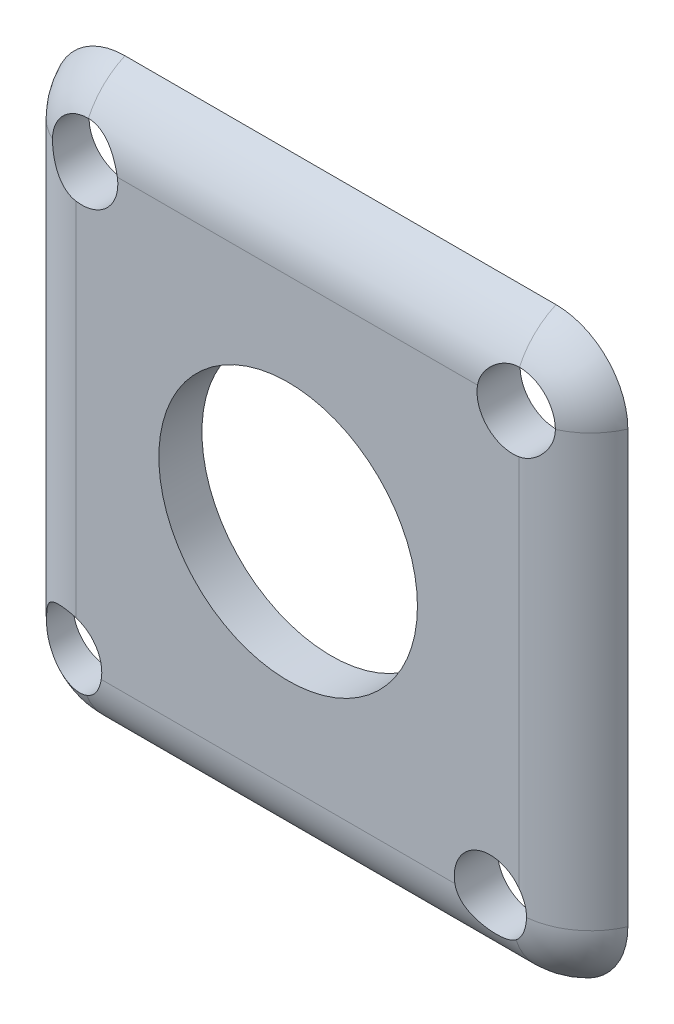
ISO-10303-21;
HEADER;
FILE_DESCRIPTION(('STEP AP214'),'2;1');
FILE_NAME('part.step','',(''),(''),'','','');
FILE_SCHEMA(('AUTOMOTIVE_DESIGN { 1 0 10303 214 1 1 1 1 }'));
ENDSEC;
DATA;
#1=APPLICATION_CONTEXT('core data for automotive mechanical design processes');
#2=APPLICATION_PROTOCOL_DEFINITION('international standard','automotive_design',2000,#1);
#3=PRODUCT_CONTEXT('',#1,'mechanical');
#4=PRODUCT('Part','Part','',(#3));
#5=PRODUCT_RELATED_PRODUCT_CATEGORY('part','',(#4));
#6=PRODUCT_DEFINITION_FORMATION('','',#4);
#7=PRODUCT_DEFINITION_CONTEXT('part definition',#1,'design');
#8=PRODUCT_DEFINITION('design','',#6,#7);
#9=PRODUCT_DEFINITION_SHAPE('','',#8);
#10=(LENGTH_UNIT() NAMED_UNIT(*) SI_UNIT(.MILLI.,.METRE.));
#11=(NAMED_UNIT(*) PLANE_ANGLE_UNIT() SI_UNIT($,.RADIAN.));
#12=(NAMED_UNIT(*) SI_UNIT($,.STERADIAN.) SOLID_ANGLE_UNIT());
#13=UNCERTAINTY_MEASURE_WITH_UNIT(LENGTH_MEASURE(1.E-05),#10,'distance_accuracy_value','');
#14=(GEOMETRIC_REPRESENTATION_CONTEXT(3) GLOBAL_UNCERTAINTY_ASSIGNED_CONTEXT((#13)) GLOBAL_UNIT_ASSIGNED_CONTEXT((#10,
#11,#12)) REPRESENTATION_CONTEXT('',''));
#15=CARTESIAN_POINT('',(0.,0.,0.));
#16=DIRECTION('',(0.,0.,1.));
#17=DIRECTION('',(1.,0.,0.));
#18=AXIS2_PLACEMENT_3D('',#15,#16,#17);
#19=CARTESIAN_POINT('',(0.,0.,3.));
#20=DIRECTION('',(0.,0.,1.));
#21=DIRECTION('',(1.,0.,0.));
#22=AXIS2_PLACEMENT_3D('',#19,#20,#21);
#23=PLANE('',#22);
#24=CARTESIAN_POINT('',(11.9527955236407,-13.2876712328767,3.));
#25=DIRECTION('',(0.,0.,1.));
#26=DIRECTION('',(1.,0.,0.));
#27=AXIS2_PLACEMENT_3D('',#24,#25,#26);
#28=CIRCLE('',#27,9.);
#29=CARTESIAN_POINT('',(20.9527955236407,-13.2876712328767,3.));
#30=VERTEX_POINT('',#29);
#31=EDGE_CURVE('E332',#30,#30,#28,.T.);
#32=ORIENTED_EDGE('',*,*,#31,.F.);
#33=EDGE_LOOP('',(#32));
#34=FACE_BOUND('',#33,.T.);
#35=CARTESIAN_POINT('',(26.0154238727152,-28.2459220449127,3.));
#36=DIRECTION('',(0.,0.,1.));
#37=DIRECTION('',(1.,0.,0.));
#38=AXIS2_PLACEMENT_3D('',#35,#36,#37);
#39=CIRCLE('',#38,2.5);
#40=CARTESIAN_POINT('',(28.0150012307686,-26.7453586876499,3.));
#41=VERTEX_POINT('',#40);
#42=CARTESIAN_POINT('',(23.5579536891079,-28.7050955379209,3.));
#43=VERTEX_POINT('',#42);
#44=EDGE_CURVE('E305',#41,#43,#39,.T.);
#45=ORIENTED_EDGE('',*,*,#44,.F.);
#46=DIRECTION('',(0.,-1.,0.));
#47=VECTOR('',#46,1.);
#48=CARTESIAN_POINT('',(28.0150012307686,1.71232876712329,3.));
#49=LINE('',#48,#47);
#50=CARTESIAN_POINT('',(28.0150012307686,-0.752576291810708,3.));
#51=VERTEX_POINT('',#50);
#52=EDGE_CURVE('E286',#41,#51,#49,.F.);
#53=ORIENTED_EDGE('',*,*,#52,.T.);
#54=CARTESIAN_POINT('',(27.5975769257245,1.71232876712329,3.));
#55=DIRECTION('',(0.,0.,1.));
#56=DIRECTION('',(1.,0.,0.));
#57=AXIS2_PLACEMENT_3D('',#54,#55,#56);
#58=CIRCLE('',#57,2.5);
#59=CARTESIAN_POINT('',(25.1326718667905,2.12975307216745,3.));
#60=VERTEX_POINT('',#59);
#61=EDGE_CURVE('E320',#60,#51,#58,.T.);
#62=ORIENTED_EDGE('',*,*,#61,.F.);
#63=DIRECTION('',(1.,0.,0.));
#64=VECTOR('',#63,1.);
#65=CARTESIAN_POINT('',(-2.40242307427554,2.12975307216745,3.));
#66=LINE('',#65,#64);
#67=CARTESIAN_POINT('',(0.0624819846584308,2.12975307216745,3.));
#68=VERTEX_POINT('',#67);
#69=EDGE_CURVE('E198',#60,#68,#66,.F.);
#70=ORIENTED_EDGE('',*,*,#69,.T.);
#71=CARTESIAN_POINT('',(-2.40242307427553,1.71232876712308,3.));
#72=DIRECTION('',(0.,0.,1.));
#73=DIRECTION('',(1.,0.,0.));
#74=AXIS2_PLACEMENT_3D('',#71,#72,#73);
#75=CIRCLE('',#74,2.5);
#76=CARTESIAN_POINT('',(-2.8198473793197,-0.752576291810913,3.));
#77=VERTEX_POINT('',#76);
#78=EDGE_CURVE('E341',#77,#68,#75,.T.);
#79=ORIENTED_EDGE('',*,*,#78,.F.);
#80=DIRECTION('',(0.,1.,0.));
#81=VECTOR('',#80,1.);
#82=CARTESIAN_POINT('',(-2.8198473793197,-28.2876712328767,3.));
#83=LINE('',#82,#81);
#84=CARTESIAN_POINT('',(-2.8198473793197,-25.8665557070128,3.));
#85=VERTEX_POINT('',#84);
#86=EDGE_CURVE('E287',#77,#85,#83,.F.);
#87=ORIENTED_EDGE('',*,*,#86,.T.);
#88=CARTESIAN_POINT('',(-3.51867607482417,-28.2668970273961,3.));
#89=DIRECTION('',(0.,0.,1.));
#90=DIRECTION('',(1.,0.,0.));
#91=AXIS2_PLACEMENT_3D('',#88,#89,#90);
#92=CIRCLE('',#91,2.5);
#93=CARTESIAN_POINT('',(-1.05737924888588,-28.7050955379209,3.));
#94=VERTEX_POINT('',#93);
#95=EDGE_CURVE('E312',#94,#85,#92,.T.);
#96=ORIENTED_EDGE('',*,*,#95,.F.);
#97=DIRECTION('',(-1.,0.,0.));
#98=VECTOR('',#97,1.);
#99=CARTESIAN_POINT('',(27.5975769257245,-28.7050955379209,3.));
#100=LINE('',#99,#98);
#101=EDGE_CURVE('E281',#94,#43,#100,.F.);
#102=ORIENTED_EDGE('',*,*,#101,.T.);
#103=EDGE_LOOP('',(#45,#53,#62,#70,#79,#87,#96,#102));
#104=FACE_BOUND('',#103,.T.);
#105=ADVANCED_FACE('F35',(#34,#104),#23,.T.);
#106=CARTESIAN_POINT('',(0.,0.,0.));
#107=DIRECTION('',(0.,0.,1.));
#108=DIRECTION('',(1.,0.,0.));
#109=AXIS2_PLACEMENT_3D('',#106,#107,#108);
#110=PLANE('',#109);
#111=CARTESIAN_POINT('',(11.9527955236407,-13.2876712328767,0.));
#112=DIRECTION('',(0.,0.,1.));
#113=DIRECTION('',(1.,0.,0.));
#114=AXIS2_PLACEMENT_3D('',#111,#112,#113);
#115=CIRCLE('',#114,9.);
#116=CARTESIAN_POINT('',(20.9527955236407,-13.2876712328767,0.));
#117=VERTEX_POINT('',#116);
#118=EDGE_CURVE('E330',#117,#117,#115,.T.);
#119=ORIENTED_EDGE('',*,*,#118,.T.);
#120=EDGE_LOOP('',(#119));
#121=FACE_BOUND('',#120,.T.);
#122=CARTESIAN_POINT('',(26.0154238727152,-28.2459220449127,0.));
#123=DIRECTION('',(0.,0.,1.));
#124=DIRECTION('',(1.,0.,0.));
#125=AXIS2_PLACEMENT_3D('',#122,#123,#124);
#126=CIRCLE('',#125,2.5);
#127=CARTESIAN_POINT('',(28.5154238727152,-28.2459220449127,0.));
#128=VERTEX_POINT('',#127);
#129=EDGE_CURVE('E308',#128,#128,#126,.T.);
#130=ORIENTED_EDGE('',*,*,#129,.T.);
#131=EDGE_LOOP('',(#130));
#132=FACE_BOUND('',#131,.T.);
#133=CARTESIAN_POINT('',(-3.51867607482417,-28.2668970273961,0.));
#134=DIRECTION('',(0.,0.,1.));
#135=DIRECTION('',(1.,0.,0.));
#136=AXIS2_PLACEMENT_3D('',#133,#134,#135);
#137=CIRCLE('',#136,2.5);
#138=CARTESIAN_POINT('',(-1.01867607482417,-28.2668970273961,0.));
#139=VERTEX_POINT('',#138);
#140=EDGE_CURVE('E343',#139,#139,#137,.T.);
#141=ORIENTED_EDGE('',*,*,#140,.T.);
#142=EDGE_LOOP('',(#141));
#143=FACE_BOUND('',#142,.T.);
#144=CARTESIAN_POINT('',(-2.40242307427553,1.71232876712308,0.));
#145=DIRECTION('',(0.,0.,1.));
#146=DIRECTION('',(1.,0.,0.));
#147=AXIS2_PLACEMENT_3D('',#144,#145,#146);
#148=CIRCLE('',#147,2.5);
#149=CARTESIAN_POINT('',(0.0975769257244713,1.71232876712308,0.));
#150=VERTEX_POINT('',#149);
#151=EDGE_CURVE('E322',#150,#150,#148,.T.);
#152=ORIENTED_EDGE('',*,*,#151,.T.);
#153=EDGE_LOOP('',(#152));
#154=FACE_BOUND('',#153,.T.);
#155=CARTESIAN_POINT('',(27.5975769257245,1.71232876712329,0.));
#156=DIRECTION('',(0.,0.,1.));
#157=DIRECTION('',(1.,0.,0.));
#158=AXIS2_PLACEMENT_3D('',#155,#156,#157);
#159=CIRCLE('',#158,2.5);
#160=CARTESIAN_POINT('',(30.0975769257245,1.71232876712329,0.));
#161=VERTEX_POINT('',#160);
#162=EDGE_CURVE('E316',#161,#161,#159,.T.);
#163=ORIENTED_EDGE('',*,*,#162,.T.);
#164=EDGE_LOOP('',(#163));
#165=FACE_BOUND('',#164,.T.);
#166=DIRECTION('',(0.,-1.,0.));
#167=VECTOR('',#166,1.);
#168=CARTESIAN_POINT('',(-7.40242307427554,6.71232876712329,0.));
#169=LINE('',#168,#167);
#170=CARTESIAN_POINT('',(-7.40242307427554,1.71232876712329,0.));
#171=VERTEX_POINT('',#170);
#172=CARTESIAN_POINT('',(-7.40242307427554,-28.2876712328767,0.));
#173=VERTEX_POINT('',#172);
#174=EDGE_CURVE('E319',#171,#173,#169,.T.);
#175=ORIENTED_EDGE('',*,*,#174,.F.);
#176=CARTESIAN_POINT('',(-2.40242307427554,1.71232876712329,0.));
#177=DIRECTION('',(0.,0.,1.));
#178=DIRECTION('',(1.,0.,0.));
#179=AXIS2_PLACEMENT_3D('',#176,#177,#178);
#180=CIRCLE('',#179,5.);
#181=CARTESIAN_POINT('',(-2.40242307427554,6.71232876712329,0.));
#182=VERTEX_POINT('',#181);
#183=EDGE_CURVE('E129',#171,#182,#180,.F.);
#184=ORIENTED_EDGE('',*,*,#183,.T.);
#185=DIRECTION('',(-1.,0.,0.));
#186=VECTOR('',#185,1.);
#187=CARTESIAN_POINT('',(-7.40242307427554,6.71232876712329,0.));
#188=LINE('',#187,#186);
#189=CARTESIAN_POINT('',(27.5975769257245,6.71232876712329,0.));
#190=VERTEX_POINT('',#189);
#191=EDGE_CURVE('E122',#190,#182,#188,.T.);
#192=ORIENTED_EDGE('',*,*,#191,.F.);
#193=CARTESIAN_POINT('',(27.5975769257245,1.71232876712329,0.));
#194=DIRECTION('',(0.,0.,1.));
#195=DIRECTION('',(1.,0.,0.));
#196=AXIS2_PLACEMENT_3D('',#193,#194,#195);
#197=CIRCLE('',#196,5.);
#198=CARTESIAN_POINT('',(32.5975769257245,1.71232876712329,0.));
#199=VERTEX_POINT('',#198);
#200=EDGE_CURVE('E126',#190,#199,#197,.F.);
#201=ORIENTED_EDGE('',*,*,#200,.T.);
#202=DIRECTION('',(0.,1.,0.));
#203=VECTOR('',#202,1.);
#204=CARTESIAN_POINT('',(32.5975769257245,6.71232876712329,0.));
#205=LINE('',#204,#203);
#206=CARTESIAN_POINT('',(32.5975769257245,-28.2876712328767,0.));
#207=VERTEX_POINT('',#206);
#208=EDGE_CURVE('E133',#207,#199,#205,.T.);
#209=ORIENTED_EDGE('',*,*,#208,.F.);
#210=CARTESIAN_POINT('',(27.5975769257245,-28.2876712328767,0.));
#211=DIRECTION('',(0.,0.,1.));
#212=DIRECTION('',(1.,0.,0.));
#213=AXIS2_PLACEMENT_3D('',#210,#211,#212);
#214=CIRCLE('',#213,5.);
#215=CARTESIAN_POINT('',(27.5975769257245,-33.2876712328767,0.));
#216=VERTEX_POINT('',#215);
#217=EDGE_CURVE('E150',#207,#216,#214,.F.);
#218=ORIENTED_EDGE('',*,*,#217,.T.);
#219=DIRECTION('',(1.,0.,0.));
#220=VECTOR('',#219,1.);
#221=CARTESIAN_POINT('',(-7.40242307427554,-33.2876712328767,0.));
#222=LINE('',#221,#220);
#223=CARTESIAN_POINT('',(-2.40242307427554,-33.2876712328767,0.));
#224=VERTEX_POINT('',#223);
#225=EDGE_CURVE('E324',#224,#216,#222,.T.);
#226=ORIENTED_EDGE('',*,*,#225,.F.);
#227=CARTESIAN_POINT('',(-2.40242307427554,-28.2876712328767,0.));
#228=DIRECTION('',(0.,0.,1.));
#229=DIRECTION('',(1.,0.,0.));
#230=AXIS2_PLACEMENT_3D('',#227,#228,#229);
#231=CIRCLE('',#230,5.);
#232=EDGE_CURVE('E153',#224,#173,#231,.F.);
#233=ORIENTED_EDGE('',*,*,#232,.T.);
#234=EDGE_LOOP('',(#175,#184,#192,#201,#209,#218,#226,#233));
#235=FACE_BOUND('',#234,.T.);
#236=ADVANCED_FACE('F124',(#121,#132,#143,#154,#165,#235),#110,.F.);
#237=CARTESIAN_POINT('',(27.5975769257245,1.71232876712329,0.));
#238=DIRECTION('',(0.,0.,1.));
#239=DIRECTION('',(1.,0.,0.));
#240=AXIS2_PLACEMENT_3D('',#237,#238,#239);
#241=CYLINDRICAL_SURFACE('',#240,2.5);
#242=ORIENTED_EDGE('',*,*,#162,.F.);
#243=EDGE_LOOP('',(#242));
#244=FACE_BOUND('',#243,.T.);
#245=ORIENTED_EDGE('',*,*,#61,.T.);
#246=CARTESIAN_POINT('',(28.0150012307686,-0.752576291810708,3.));
#247=CARTESIAN_POINT('',(28.0812790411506,-0.741362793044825,3.00001101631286));
#248=CARTESIAN_POINT('',(28.1470891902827,-0.727458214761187,2.99868247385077));
#249=CARTESIAN_POINT('',(28.2772567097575,-0.694438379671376,2.99353916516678));
#250=CARTESIAN_POINT('',(28.3416147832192,-0.675325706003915,2.98972563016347));
#251=CARTESIAN_POINT('',(28.4681475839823,-0.632145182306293,2.97982674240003));
#252=CARTESIAN_POINT('',(28.5303306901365,-0.608099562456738,2.97375148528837));
#253=CARTESIAN_POINT('',(28.6523794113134,-0.55522940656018,2.95958959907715));
#254=CARTESIAN_POINT('',(28.712244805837,-0.526404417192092,2.95150277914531));
#255=CARTESIAN_POINT('',(28.887600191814,-0.433203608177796,2.92468208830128));
#256=CARTESIAN_POINT('',(28.9991584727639,-0.361995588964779,2.90336140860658));
#257=CARTESIAN_POINT('',(29.2091881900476,-0.20341820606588,2.85649600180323));
#258=CARTESIAN_POINT('',(29.3076427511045,-0.116028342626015,2.83094592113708));
#259=CARTESIAN_POINT('',(29.4948909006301,0.0784801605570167,2.77702480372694));
#260=CARTESIAN_POINT('',(29.5827728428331,0.18645811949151,2.74857626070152));
#261=CARTESIAN_POINT('',(29.7396316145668,0.415824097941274,2.69388576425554));
#262=CARTESIAN_POINT('',(29.8086114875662,0.537209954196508,2.66764345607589));
#263=CARTESIAN_POINT('',(29.9272586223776,0.794147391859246,2.6203353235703));
#264=CARTESIAN_POINT('',(29.9763802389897,0.929984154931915,2.5994209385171));
#265=CARTESIAN_POINT('',(30.0320634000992,1.13916978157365,2.57513388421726));
#266=CARTESIAN_POINT('',(30.0476267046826,1.20982723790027,2.56821785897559));
#267=CARTESIAN_POINT('',(30.072589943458,1.35241713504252,2.55702996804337));
#268=CARTESIAN_POINT('',(30.081993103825,1.42434888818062,2.55275671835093));
#269=CARTESIAN_POINT('',(30.0940150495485,1.56313264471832,2.5472783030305));
#270=CARTESIAN_POINT('',(30.0971123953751,1.62993549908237,2.54585685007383));
#271=CARTESIAN_POINT('',(30.0979445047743,1.76358518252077,2.54547536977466));
#272=CARTESIAN_POINT('',(30.0956792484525,1.83043201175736,2.54651535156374));
#273=CARTESIAN_POINT('',(30.0857921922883,1.96386985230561,2.5510285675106));
#274=CARTESIAN_POINT('',(30.0781523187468,2.03045923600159,2.55451001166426));
#275=CARTESIAN_POINT('',(30.057595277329,2.16266004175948,2.56376048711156));
#276=CARTESIAN_POINT('',(30.0446779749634,2.22827143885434,2.56952957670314));
#277=CARTESIAN_POINT('',(30.0291715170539,2.29314521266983,2.57636515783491));
#278=B_SPLINE_CURVE_WITH_KNOTS('',3,(#246,#247,#248,#249,#250,#251,#252,#253,#254,#255,#256,
#257,#258,#259,#260,#261,#262,#263,#264,#265,#266,#267,#268,#269,#270,#271,#272,#273,#274,#275,
#276,#277),.UNSPECIFIED.,.F.,.F.,(4,2,2,2,2,2,2,2,2,2,2,2,2,2,2,4),(0.,0.201572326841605,
0.403044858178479,0.603628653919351,0.804231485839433,1.20446555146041,1.60521016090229,
2.02957851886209,2.45387850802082,2.88915259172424,3.10693115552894,3.32459557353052,
3.52501190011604,3.7254289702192,3.92652324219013,4.1276226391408),.UNSPECIFIED.);
#279=CARTESIAN_POINT('',(30.0975769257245,1.71232876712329,2.54564390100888));
#280=VERTEX_POINT('',#279);
#281=EDGE_CURVE('E209',#51,#280,#278,.T.);
#282=ORIENTED_EDGE('',*,*,#281,.T.);
#283=CARTESIAN_POINT('',(27.5975769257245,1.71232876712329,2.54564390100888));
#284=DIRECTION('',(0.,0.,-1.));
#285=DIRECTION('',(-1.,0.,0.));
#286=AXIS2_PLACEMENT_3D('',#283,#284,#285);
#287=CIRCLE('',#286,2.5);
#288=CARTESIAN_POINT('',(27.5975769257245,4.21232876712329,2.54564390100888));
#289=VERTEX_POINT('',#288);
#290=EDGE_CURVE('E217',#280,#289,#287,.F.);
#291=ORIENTED_EDGE('',*,*,#290,.T.);
#292=CARTESIAN_POINT('',(27.5975769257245,4.21232876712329,2.54564390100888));
#293=CARTESIAN_POINT('',(27.5303582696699,4.21233909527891,2.54562712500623));
#294=CARTESIAN_POINT('',(27.4631481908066,4.209618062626,2.54688553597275));
#295=CARTESIAN_POINT('',(27.3292817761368,4.19879443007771,2.55182734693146));
#296=CARTESIAN_POINT('',(27.2626252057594,4.19069424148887,2.55550966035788));
#297=CARTESIAN_POINT('',(27.1306375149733,4.16924146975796,2.56515245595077));
#298=CARTESIAN_POINT('',(27.0653017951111,4.15591257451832,2.57110266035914));
#299=CARTESIAN_POINT('',(26.9361192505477,4.12415451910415,2.58504771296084));
#300=CARTESIAN_POINT('',(26.8722725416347,4.10572496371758,2.59304271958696));
#301=CARTESIAN_POINT('',(26.6837729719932,4.04308881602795,2.61965597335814));
#302=CARTESIAN_POINT('',(26.5618638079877,3.99148571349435,2.64092621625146));
#303=CARTESIAN_POINT('',(26.3282706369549,3.87016243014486,2.68776999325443));
#304=CARTESIAN_POINT('',(26.2165997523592,3.80041942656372,2.71334893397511));
#305=CARTESIAN_POINT('',(25.9996133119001,3.63995309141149,2.76726865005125));
#306=CARTESIAN_POINT('',(25.8950376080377,3.54825047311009,2.79568360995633));
#307=CARTESIAN_POINT('',(25.7022467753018,3.34848645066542,2.85030072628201));
#308=CARTESIAN_POINT('',(25.6140303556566,3.24042633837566,2.87650305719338));
#309=CARTESIAN_POINT('',(25.4541654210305,3.00703617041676,2.92390691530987));
#310=CARTESIAN_POINT('',(25.3830273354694,2.88131925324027,2.94495468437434));
#311=CARTESIAN_POINT('',(25.2931649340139,2.68439810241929,2.96958578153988));
#312=CARTESIAN_POINT('',(25.266013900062,2.6173501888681,2.97664022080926));
#313=CARTESIAN_POINT('',(25.2175718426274,2.48096381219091,2.98811774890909));
#314=CARTESIAN_POINT('',(25.1962776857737,2.41162659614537,2.99254224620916));
#315=CARTESIAN_POINT('',(25.1611929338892,2.27669703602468,2.99826075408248));
#316=CARTESIAN_POINT('',(25.1469486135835,2.21123108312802,2.99977085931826));
#317=CARTESIAN_POINT('',(25.1237598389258,2.07935803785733,3.00018083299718));
#318=CARTESIAN_POINT('',(25.114815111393,2.01295099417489,2.9990808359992));
#319=CARTESIAN_POINT('',(25.1022672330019,1.87947155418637,2.99417937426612));
#320=CARTESIAN_POINT('',(25.0986851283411,1.81239757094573,2.99036735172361));
#321=CARTESIAN_POINT('',(25.0969058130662,1.67837135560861,2.9800410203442));
#322=CARTESIAN_POINT('',(25.0987097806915,1.61141915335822,2.97352612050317));
#323=CARTESIAN_POINT('',(25.10319591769,1.54480746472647,2.9656659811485));
#324=B_SPLINE_CURVE_WITH_KNOTS('',3,(#292,#293,#294,#295,#296,#297,#298,#299,#300,#301,#302,
#303,#304,#305,#306,#307,#308,#309,#310,#311,#312,#313,#314,#315,#316,#317,#318,#319,#320,#321,
#322,#323),.UNSPECIFIED.,.F.,.F.,(4,2,2,2,2,2,2,2,2,2,2,2,2,2,2,4),(0.,0.201574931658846,
0.403059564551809,0.603641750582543,0.8042394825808,1.20454084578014,1.60534830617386,
2.02931077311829,2.4532397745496,2.88859073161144,3.10636754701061,3.32402762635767,
3.52481401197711,3.72559004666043,3.92715200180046,4.12875805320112),.UNSPECIFIED.);
#325=EDGE_CURVE('E140',#289,#60,#324,.T.);
#326=ORIENTED_EDGE('',*,*,#325,.T.);
#327=EDGE_LOOP('',(#245,#282,#291,#326));
#328=FACE_BOUND('',#327,.T.);
#329=ADVANCED_FACE('F187',(#244,#328),#241,.F.);
#330=CARTESIAN_POINT('',(-2.40242307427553,1.71232876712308,0.));
#331=DIRECTION('',(0.,0.,1.));
#332=DIRECTION('',(1.,0.,0.));
#333=AXIS2_PLACEMENT_3D('',#330,#331,#332);
#334=CYLINDRICAL_SURFACE('',#333,2.5);
#335=ORIENTED_EDGE('',*,*,#151,.F.);
#336=EDGE_LOOP('',(#335));
#337=FACE_BOUND('',#336,.T.);
#338=CARTESIAN_POINT('',(-2.40242307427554,1.71232876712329,2.54564390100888));
#339=DIRECTION('',(0.,0.,-1.));
#340=DIRECTION('',(-1.,0.,0.));
#341=AXIS2_PLACEMENT_3D('',#338,#339,#340);
#342=CIRCLE('',#341,2.5);
#343=CARTESIAN_POINT('',(-2.40242307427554,4.21232876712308,2.54564390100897));
#344=VERTEX_POINT('',#343);
#345=CARTESIAN_POINT('',(-4.90242307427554,1.71232876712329,2.54564390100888));
#346=VERTEX_POINT('',#345);
#347=EDGE_CURVE('E44',#344,#346,#342,.F.);
#348=ORIENTED_EDGE('',*,*,#347,.T.);
#349=CARTESIAN_POINT('',(-4.90242307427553,1.71232876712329,2.54564390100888));
#350=CARTESIAN_POINT('',(-4.90243340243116,1.64511011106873,2.54562712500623));
#351=CARTESIAN_POINT('',(-4.89971236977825,1.57790003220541,2.54688553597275));
#352=CARTESIAN_POINT('',(-4.88888873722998,1.44403361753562,2.55182734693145));
#353=CARTESIAN_POINT('',(-4.88078854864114,1.37737704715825,2.55550966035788));
#354=CARTESIAN_POINT('',(-4.85933577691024,1.24538935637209,2.56515245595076));
#355=CARTESIAN_POINT('',(-4.84600688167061,1.1800536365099,2.57110266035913));
#356=CARTESIAN_POINT('',(-4.81424882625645,1.05087109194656,2.58504771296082));
#357=CARTESIAN_POINT('',(-4.79581927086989,0.987024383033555,2.59304271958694));
#358=CARTESIAN_POINT('',(-4.73318312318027,0.798524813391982,2.61965597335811));
#359=CARTESIAN_POINT('',(-4.68158002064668,0.676615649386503,2.64092621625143));
#360=CARTESIAN_POINT('',(-4.56025673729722,0.443022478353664,2.68776999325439));
#361=CARTESIAN_POINT('',(-4.49051373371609,0.331351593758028,2.71334893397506));
#362=CARTESIAN_POINT('',(-4.33004739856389,0.114365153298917,2.7672686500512));
#363=CARTESIAN_POINT('',(-4.2383447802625,0.00978944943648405,2.79568360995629));
#364=CARTESIAN_POINT('',(-4.03858075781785,-0.183001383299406,2.85030072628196));
#365=CARTESIAN_POINT('',(-3.93052064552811,-0.271217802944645,2.87650305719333));
#366=CARTESIAN_POINT('',(-3.69713047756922,-0.431082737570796,2.92390691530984));
#367=CARTESIAN_POINT('',(-3.57141356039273,-0.502220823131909,2.94495468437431));
#368=CARTESIAN_POINT('',(-3.37449240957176,-0.592083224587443,2.96958578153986));
#369=CARTESIAN_POINT('',(-3.30744449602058,-0.61923425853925,2.97664022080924));
#370=CARTESIAN_POINT('',(-3.1710581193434,-0.667676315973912,2.98811774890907));
#371=CARTESIAN_POINT('',(-3.10172090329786,-0.688970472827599,2.99254224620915));
#372=CARTESIAN_POINT('',(-2.96679134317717,-0.724055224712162,2.99826075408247));
#373=CARTESIAN_POINT('',(-2.90132539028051,-0.738299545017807,2.99977085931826));
#374=CARTESIAN_POINT('',(-2.76945234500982,-0.761488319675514,3.00018083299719));
#375=CARTESIAN_POINT('',(-2.70304530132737,-0.770433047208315,2.9990808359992));
#376=CARTESIAN_POINT('',(-2.56956586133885,-0.78298092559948,2.99417937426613));
#377=CARTESIAN_POINT('',(-2.50249187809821,-0.786563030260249,2.99036735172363));
#378=CARTESIAN_POINT('',(-2.36846566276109,-0.788342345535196,2.98004102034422));
#379=CARTESIAN_POINT('',(-2.3015134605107,-0.786538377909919,2.97352612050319));
#380=CARTESIAN_POINT('',(-2.23490177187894,-0.782052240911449,2.96566598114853));
#381=B_SPLINE_CURVE_WITH_KNOTS('',3,(#349,#350,#351,#352,#353,#354,#355,#356,#357,#358,#359,
#360,#361,#362,#363,#364,#365,#366,#367,#368,#369,#370,#371,#372,#373,#374,#375,#376,#377,#378,
#379,#380),.UNSPECIFIED.,.F.,.F.,(4,2,2,2,2,2,2,2,2,2,2,2,2,2,2,4),(0.,0.201574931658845,
0.403059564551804,0.603641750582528,0.804239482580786,1.20454084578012,1.60534830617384,
2.02931077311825,2.45323977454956,2.8885907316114,3.10636754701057,3.32402762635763,
3.52481401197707,3.72559004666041,3.92715200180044,4.1287580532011),.UNSPECIFIED.);
#382=EDGE_CURVE('E11',#346,#77,#381,.T.);
#383=ORIENTED_EDGE('',*,*,#382,.T.);
#384=ORIENTED_EDGE('',*,*,#78,.T.);
#385=CARTESIAN_POINT('',(0.0624819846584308,2.12975307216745,3.));
#386=CARTESIAN_POINT('',(0.0512684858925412,2.19603088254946,3.00001101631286));
#387=CARTESIAN_POINT('',(0.0373639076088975,2.26184103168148,2.99868247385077));
#388=CARTESIAN_POINT('',(0.00434407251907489,2.39200855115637,2.99353916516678));
#389=CARTESIAN_POINT('',(-0.0147686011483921,2.45636662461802,2.98972563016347));
#390=CARTESIAN_POINT('',(-0.0579491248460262,2.58289942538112,2.97982674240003));
#391=CARTESIAN_POINT('',(-0.0819947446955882,2.64508253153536,2.97375148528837));
#392=CARTESIAN_POINT('',(-0.134864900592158,2.76713125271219,2.95958959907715));
#393=CARTESIAN_POINT('',(-0.163689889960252,2.82699664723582,2.95150277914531));
#394=CARTESIAN_POINT('',(-0.256890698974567,3.00235203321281,2.92468208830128));
#395=CARTESIAN_POINT('',(-0.328098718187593,3.11391031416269,2.90336140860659));
#396=CARTESIAN_POINT('',(-0.486676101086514,3.3239400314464,2.85649600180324));
#397=CARTESIAN_POINT('',(-0.57406596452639,3.42239459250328,2.8309459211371));
#398=CARTESIAN_POINT('',(-0.768574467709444,3.60964274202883,2.77702480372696));
#399=CARTESIAN_POINT('',(-0.876552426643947,3.69752468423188,2.74857626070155));
#400=CARTESIAN_POINT('',(-1.10591840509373,3.85438345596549,2.69388576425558));
#401=CARTESIAN_POINT('',(-1.22730426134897,3.92336332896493,2.66764345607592));
#402=CARTESIAN_POINT('',(-1.48424169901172,4.04201046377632,2.62033532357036));
#403=CARTESIAN_POINT('',(-1.6200784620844,4.09113208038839,2.59942093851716));
#404=CARTESIAN_POINT('',(-1.82926408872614,4.14681524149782,2.57513388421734));
#405=CARTESIAN_POINT('',(-1.89992154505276,4.16237854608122,2.56821785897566));
#406=CARTESIAN_POINT('',(-2.04251144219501,4.18734178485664,2.55702996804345));
#407=CARTESIAN_POINT('',(-2.1144431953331,4.1967449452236,2.55275671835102));
#408=CARTESIAN_POINT('',(-2.25322695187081,4.20876689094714,2.5472783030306));
#409=CARTESIAN_POINT('',(-2.32002980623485,4.21186423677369,2.54585685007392));
#410=CARTESIAN_POINT('',(-2.45367948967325,4.2126963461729,2.54547536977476));
#411=CARTESIAN_POINT('',(-2.52052631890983,4.21043108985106,2.54651535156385));
#412=CARTESIAN_POINT('',(-2.65396415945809,4.20054403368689,2.55102856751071));
#413=CARTESIAN_POINT('',(-2.72055354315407,4.19290416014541,2.55451001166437));
#414=CARTESIAN_POINT('',(-2.85275434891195,4.1723471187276,2.56376048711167));
#415=CARTESIAN_POINT('',(-2.9183657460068,4.15942981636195,2.56952957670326));
#416=CARTESIAN_POINT('',(-2.98323951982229,4.14392335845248,2.57636515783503));
#417=B_SPLINE_CURVE_WITH_KNOTS('',3,(#385,#386,#387,#388,#389,#390,#391,#392,#393,#394,#395,
#396,#397,#398,#399,#400,#401,#402,#403,#404,#405,#406,#407,#408,#409,#410,#411,#412,#413,#414,
#415,#416),.UNSPECIFIED.,.F.,.F.,(4,2,2,2,2,2,2,2,2,2,2,2,2,2,2,4),(0.,0.201572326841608,
0.403044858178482,0.603628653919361,0.804231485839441,1.20446555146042,1.6052101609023,
2.02957851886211,2.45387850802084,2.88915259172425,3.10693115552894,3.32459557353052,
3.52501190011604,3.7254289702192,3.92652324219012,4.12762263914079),.UNSPECIFIED.);
#418=EDGE_CURVE('E55',#68,#344,#417,.T.);
#419=ORIENTED_EDGE('',*,*,#418,.T.);
#420=EDGE_LOOP('',(#348,#383,#384,#419));
#421=FACE_BOUND('',#420,.T.);
#422=ADVANCED_FACE('F247',(#337,#421),#334,.F.);
#423=CARTESIAN_POINT('',(-3.51867607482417,-28.2668970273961,0.));
#424=DIRECTION('',(0.,0.,1.));
#425=DIRECTION('',(1.,0.,0.));
#426=AXIS2_PLACEMENT_3D('',#423,#424,#425);
#427=CYLINDRICAL_SURFACE('',#426,2.5);
#428=ORIENTED_EDGE('',*,*,#140,.F.);
#429=EDGE_LOOP('',(#428));
#430=FACE_BOUND('',#429,.T.);
#431=CARTESIAN_POINT('',(-6.01858975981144,-28.2876712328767,1.84292169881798));
#432=CARTESIAN_POINT('',(-6.01802693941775,-28.3563374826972,1.8433936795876));
#433=CARTESIAN_POINT('',(-6.01461958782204,-28.4249707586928,1.84459821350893));
#434=CARTESIAN_POINT('',(-6.00218269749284,-28.5616768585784,1.84844376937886));
#435=CARTESIAN_POINT('',(-5.9931538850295,-28.6297497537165,1.85108460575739));
#436=CARTESIAN_POINT('',(-5.96956075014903,-28.7647442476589,1.85776862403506));
#437=CARTESIAN_POINT('',(-5.95500582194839,-28.8316675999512,1.86180942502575));
#438=CARTESIAN_POINT('',(-5.92049654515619,-28.9639911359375,1.87124116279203));
#439=CARTESIAN_POINT('',(-5.90054216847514,-29.0293913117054,1.87663210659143));
#440=CARTESIAN_POINT('',(-5.83279697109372,-29.2226333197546,1.89474315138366));
#441=CARTESIAN_POINT('',(-5.7771042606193,-29.3476290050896,1.90940713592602));
#442=CARTESIAN_POINT('',(-5.64648030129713,-29.5863661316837,1.94324364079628));
#443=CARTESIAN_POINT('',(-5.57154667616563,-29.7001061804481,1.96241671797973));
#444=CARTESIAN_POINT('',(-5.40305385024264,-29.915583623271,2.00488879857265));
#445=CARTESIAN_POINT('',(-5.30916655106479,-30.0170505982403,2.02825954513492));
#446=CARTESIAN_POINT('',(-5.1064241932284,-30.20286662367,2.07796217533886));
#447=CARTESIAN_POINT('',(-4.99756577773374,-30.2872118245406,2.1042947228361));
#448=CARTESIAN_POINT('',(-4.76460726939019,-30.4388806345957,2.15977198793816));
#449=CARTESIAN_POINT('',(-4.64016244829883,-30.5056536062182,2.18897528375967));
#450=CARTESIAN_POINT('',(-4.38206286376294,-30.6172883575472,2.24854985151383));
#451=CARTESIAN_POINT('',(-4.24840702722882,-30.6621475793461,2.27892125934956));
#452=CARTESIAN_POINT('',(-3.9728257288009,-30.7294684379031,2.34049230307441));
#453=CARTESIAN_POINT('',(-3.830789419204,-30.7514729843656,2.37169649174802));
#454=CARTESIAN_POINT('',(-3.5448971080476,-30.7708609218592,2.43340673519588));
#455=CARTESIAN_POINT('',(-3.40104118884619,-30.7682454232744,2.46391282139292));
#456=CARTESIAN_POINT('',(-3.11516221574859,-30.7383148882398,2.52345359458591));
#457=CARTESIAN_POINT('',(-2.97314603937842,-30.710925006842,2.5524835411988));
#458=CARTESIAN_POINT('',(-2.69546046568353,-30.63187470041,2.60819885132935));
#459=CARTESIAN_POINT('',(-2.55979062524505,-30.5802159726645,2.63488437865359));
#460=CARTESIAN_POINT('',(-2.36514574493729,-30.4860188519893,2.67244007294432));
#461=CARTESIAN_POINT('',(-2.30209814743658,-30.4520911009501,2.6844806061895));
#462=CARTESIAN_POINT('',(-2.17901854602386,-30.3788718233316,2.70775282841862));
#463=CARTESIAN_POINT('',(-2.11898646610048,-30.3395804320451,2.71898453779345));
#464=CARTESIAN_POINT('',(-2.00234173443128,-30.2558394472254,2.74058480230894));
#465=CARTESIAN_POINT('',(-1.94573406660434,-30.2113825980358,2.75095210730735));
#466=CARTESIAN_POINT('',(-1.83645719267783,-30.1176621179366,2.77075496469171));
#467=CARTESIAN_POINT('',(-1.78378863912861,-30.0683976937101,2.78019036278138));
#468=CARTESIAN_POINT('',(-1.73331220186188,-30.0168901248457,2.78913270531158));
#469=B_SPLINE_CURVE_WITH_KNOTS('',3,(#431,#432,#433,#434,#435,#436,#437,#438,#439,#440,#441,
#442,#443,#444,#445,#446,#447,#448,#449,#450,#451,#452,#453,#454,#455,#456,#457,#458,#459,#460,
#461,#462,#463,#464,#465,#466,#467,#468),.UNSPECIFIED.,.F.,.F.,(4,2,2,2,2,2,2,2,2,2,2,2,2,2,2,2,
2,2,4),(0.,0.205940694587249,0.411854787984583,0.617420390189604,0.822987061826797,
1.23378194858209,1.644627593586,2.0633122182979,2.4820908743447,2.91274738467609,
3.34345415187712,3.7826181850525,4.22176241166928,4.66223776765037,5.10268232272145,
5.32027175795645,5.53785570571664,5.75574906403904,5.97367843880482),.UNSPECIFIED.);
#470=CARTESIAN_POINT('',(-6.01858975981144,-28.2876712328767,1.84292169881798));
#471=VERTEX_POINT('',#470);
#472=CARTESIAN_POINT('',(-2.40242307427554,-30.503854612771,2.66524016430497));
#473=VERTEX_POINT('',#472);
#474=EDGE_CURVE('E224',#471,#473,#469,.T.);
#475=ORIENTED_EDGE('',*,*,#474,.T.);
#476=CARTESIAN_POINT('',(-2.40242307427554,-30.503854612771,2.66524016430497));
#477=CARTESIAN_POINT('',(-2.27483546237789,-30.4402284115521,2.68977476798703));
#478=CARTESIAN_POINT('',(-2.15321001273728,-30.3658713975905,2.71695776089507));
#479=CARTESIAN_POINT('',(-1.92423592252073,-30.1976813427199,2.77284255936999));
#480=CARTESIAN_POINT('',(-1.8169178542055,-30.1038076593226,2.80154743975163));
#481=CARTESIAN_POINT('',(-1.6193745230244,-29.8987568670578,2.8565890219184));
#482=CARTESIAN_POINT('',(-1.52916584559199,-29.7875631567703,2.88292341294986));
#483=CARTESIAN_POINT('',(-1.36871560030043,-29.5506528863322,2.92945245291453));
#484=CARTESIAN_POINT('',(-1.29842795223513,-29.4249708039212,2.94966127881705));
#485=CARTESIAN_POINT('',(-1.2107661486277,-29.2304385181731,2.97273817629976));
#486=CARTESIAN_POINT('',(-1.18481002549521,-29.1657522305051,2.97917212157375));
#487=CARTESIAN_POINT('',(-1.13833390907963,-29.0342473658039,2.98958921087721));
#488=CARTESIAN_POINT('',(-1.11781334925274,-28.9674290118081,2.9935726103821));
#489=CARTESIAN_POINT('',(-1.08231480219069,-28.8317757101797,2.99885794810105));
#490=CARTESIAN_POINT('',(-1.06737308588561,-28.7629306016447,3.00014258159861));
#491=CARTESIAN_POINT('',(-1.04333518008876,-28.6241981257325,2.99983082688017));
#492=CARTESIAN_POINT('',(-1.03424203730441,-28.5543102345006,2.9982329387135));
#493=CARTESIAN_POINT('',(-1.02813970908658,-28.4842184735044,2.99511894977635));
#494=B_SPLINE_CURVE_WITH_KNOTS('',3,(#476,#477,#478,#479,#480,#481,#482,#483,#484,#485,#486,
#487,#488,#489,#490,#491,#492,#493),.UNSPECIFIED.,.F.,.F.,(4,2,2,2,2,2,2,2,4),(0.,
0.433371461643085,0.8676546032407,1.30235660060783,1.73604470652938,1.94579774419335,
2.15552891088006,2.36660083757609,2.57778262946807),.UNSPECIFIED.);
#495=EDGE_CURVE('E258',#473,#94,#494,.T.);
#496=ORIENTED_EDGE('',*,*,#495,.T.);
#497=ORIENTED_EDGE('',*,*,#95,.T.);
#498=CARTESIAN_POINT('',(-2.8198473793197,-25.8665557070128,3.));
#499=CARTESIAN_POINT('',(-2.88186506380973,-25.8484895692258,3.00001031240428));
#500=CARTESIAN_POINT('',(-2.94458796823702,-25.8328463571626,2.9988463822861));
#501=CARTESIAN_POINT('',(-3.07095807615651,-25.8064699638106,2.99408791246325));
#502=CARTESIAN_POINT('',(-3.13460515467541,-25.7957361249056,2.99049369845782));
#503=CARTESIAN_POINT('',(-3.26211272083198,-25.7792689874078,2.98081093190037));
#504=CARTESIAN_POINT('',(-3.32597149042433,-25.7735169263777,2.97473186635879));
#505=CARTESIAN_POINT('',(-3.45363854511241,-25.7669246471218,2.96008535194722));
#506=CARTESIAN_POINT('',(-3.51744683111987,-25.7660843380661,2.95151794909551));
#507=CARTESIAN_POINT('',(-3.70809942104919,-25.7708531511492,2.92214039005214));
#508=CARTESIAN_POINT('',(-3.83428297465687,-25.783737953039,2.89764644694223));
#509=CARTESIAN_POINT('',(-4.08128321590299,-25.8277862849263,2.839930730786));
#510=CARTESIAN_POINT('',(-4.20209689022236,-25.8589599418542,2.80670412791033));
#511=CARTESIAN_POINT('',(-4.44029324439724,-25.939448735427,2.73184091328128));
#512=CARTESIAN_POINT('',(-4.55737194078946,-25.989407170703,2.68993309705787));
#513=CARTESIAN_POINT('',(-4.78111435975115,-26.1053800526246,2.60086564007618));
#514=CARTESIAN_POINT('',(-4.88777166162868,-26.1714043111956,2.55370279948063));
#515=CARTESIAN_POINT('',(-5.10233605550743,-26.3273562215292,2.45041364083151));
#516=CARTESIAN_POINT('',(-5.20862222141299,-26.4192705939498,2.39391675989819));
#517=CARTESIAN_POINT('',(-5.40461786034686,-26.6198095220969,2.28155711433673));
#518=CARTESIAN_POINT('',(-5.49431756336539,-26.7284438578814,2.22569474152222));
#519=CARTESIAN_POINT('',(-5.64764508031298,-26.9501182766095,2.12446269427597));
#520=CARTESIAN_POINT('',(-5.71293205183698,-27.0617816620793,2.07860030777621));
#521=CARTESIAN_POINT('',(-5.8263090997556,-27.2964674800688,1.99576358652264));
#522=CARTESIAN_POINT('',(-5.87443391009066,-27.4194663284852,1.95877135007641));
#523=CARTESIAN_POINT('',(-5.94445629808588,-27.6523322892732,1.90364630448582));
#524=CARTESIAN_POINT('',(-5.96946515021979,-27.7607454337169,1.88334892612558));
#525=CARTESIAN_POINT('',(-6.00484098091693,-27.9815402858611,1.85439614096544));
#526=CARTESIAN_POINT('',(-6.0152163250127,-28.0939196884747,1.84573408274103));
#527=CARTESIAN_POINT('',(-6.01931251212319,-28.2628339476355,1.84231774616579));
#528=CARTESIAN_POINT('',(-6.01876403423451,-28.3192208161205,1.84277737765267));
#529=CARTESIAN_POINT('',(-6.01386973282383,-28.4317403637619,1.84684750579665));
#530=CARTESIAN_POINT('',(-6.00952318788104,-28.4878729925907,1.85045860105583));
#531=CARTESIAN_POINT('',(-5.99706893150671,-28.5996847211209,1.86074221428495));
#532=CARTESIAN_POINT('',(-5.98894436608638,-28.655360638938,1.86742844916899));
#533=CARTESIAN_POINT('',(-5.96906753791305,-28.7656242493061,1.88362750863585));
#534=CARTESIAN_POINT('',(-5.95731660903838,-28.8202123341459,1.89313929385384));
#535=CARTESIAN_POINT('',(-5.94381903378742,-28.8740886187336,1.90394686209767));
#536=B_SPLINE_CURVE_WITH_KNOTS('',3,(#498,#499,#500,#501,#502,#503,#504,#505,#506,#507,#508,
#509,#510,#511,#512,#513,#514,#515,#516,#517,#518,#519,#520,#521,#522,#523,#524,#525,#526,#527,
#528,#529,#530,#531,#532,#533,#534,#535),.UNSPECIFIED.,.F.,.F.,(4,2,2,2,2,2,2,2,2,2,2,2,2,2,2,2,
2,2,4),(0.,0.193725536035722,0.387425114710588,0.580391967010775,0.773355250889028,
1.15894803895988,1.54475453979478,1.9451956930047,2.3458820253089,2.79836758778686,
3.25111883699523,3.66126290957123,4.07057212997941,4.40845537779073,4.74614538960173,
4.91513739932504,5.08416151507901,5.25394700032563,5.42367010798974),.UNSPECIFIED.);
#537=EDGE_CURVE('E216',#85,#471,#536,.T.);
#538=ORIENTED_EDGE('',*,*,#537,.T.);
#539=EDGE_LOOP('',(#475,#496,#497,#538));
#540=FACE_BOUND('',#539,.T.);
#541=ADVANCED_FACE('F183',(#430,#540),#427,.F.);
#542=CARTESIAN_POINT('',(26.0154238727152,-28.2459220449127,0.));
#543=DIRECTION('',(0.,0.,1.));
#544=DIRECTION('',(1.,0.,0.));
#545=AXIS2_PLACEMENT_3D('',#542,#543,#544);
#546=CYLINDRICAL_SURFACE('',#545,2.5);
#547=ORIENTED_EDGE('',*,*,#129,.F.);
#548=EDGE_LOOP('',(#547));
#549=FACE_BOUND('',#548,.T.);
#550=CARTESIAN_POINT('',(27.5975769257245,-30.1815851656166,2.77702610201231));
#551=CARTESIAN_POINT('',(27.651102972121,-30.1378443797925,2.79055014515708));
#552=CARTESIAN_POINT('',(27.7029053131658,-30.0917900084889,2.80342058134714));
#553=CARTESIAN_POINT('',(27.8026756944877,-29.9953605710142,2.82779879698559));
#554=CARTESIAN_POINT('',(27.8506433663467,-29.9449850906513,2.83930644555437));
#555=CARTESIAN_POINT('',(27.9422763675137,-29.8403092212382,2.86088437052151));
#556=CARTESIAN_POINT('',(27.9859482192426,-29.7860150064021,2.87095683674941));
#557=CARTESIAN_POINT('',(28.0687024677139,-29.6738267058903,2.88965073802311));
#558=CARTESIAN_POINT('',(28.1077851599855,-29.6159328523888,2.89827226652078));
#559=CARTESIAN_POINT('',(28.2172991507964,-29.4379951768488,2.92185731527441));
#560=CARTESIAN_POINT('',(28.2805150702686,-29.3131026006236,2.93466213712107));
#561=CARTESIAN_POINT('',(28.3852932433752,-29.0541455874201,2.95471908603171));
#562=CARTESIAN_POINT('',(28.4268585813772,-28.9200824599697,2.9619720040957));
#563=CARTESIAN_POINT('',(28.4717235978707,-28.7163885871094,2.96926123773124));
#564=CARTESIAN_POINT('',(28.4837352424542,-28.6486315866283,2.97109185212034));
#565=CARTESIAN_POINT('',(28.5021396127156,-28.5123211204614,2.9737153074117));
#566=CARTESIAN_POINT('',(28.5085323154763,-28.4437676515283,2.97450814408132));
#567=CARTESIAN_POINT('',(28.5156456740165,-28.3062490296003,2.97511491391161));
#568=CARTESIAN_POINT('',(28.5163565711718,-28.2372833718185,2.97492716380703));
#569=CARTESIAN_POINT('',(28.5120873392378,-28.0995362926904,2.97354110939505));
#570=CARTESIAN_POINT('',(28.5071070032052,-28.0307548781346,2.97234276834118));
#571=CARTESIAN_POINT('',(28.4992843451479,-27.9623075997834,2.97062525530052));
#572=B_SPLINE_CURVE_WITH_KNOTS('',3,(#550,#551,#552,#553,#554,#555,#556,#557,#558,#559,#560,
#561,#562,#563,#564,#565,#566,#567,#568,#569,#570,#571),.UNSPECIFIED.,.F.,.F.,(4,2,2,2,2,2,2,2,
2,2,4),(0.,0.211246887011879,0.422514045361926,0.633455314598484,0.844382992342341,
1.26387934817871,1.68331592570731,1.88962889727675,2.09594271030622,2.3026107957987,
2.50928639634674),.UNSPECIFIED.);
#573=CARTESIAN_POINT('',(27.5975769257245,-30.1815851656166,2.77702610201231));
#574=VERTEX_POINT('',#573);
#575=CARTESIAN_POINT('',(28.5150752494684,-28.2876712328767,2.97492974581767));
#576=VERTEX_POINT('',#575);
#577=EDGE_CURVE('E167',#574,#576,#572,.T.);
#578=ORIENTED_EDGE('',*,*,#577,.T.);
#579=CARTESIAN_POINT('',(28.5150752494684,-28.2876712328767,2.97492974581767));
#580=CARTESIAN_POINT('',(28.5162716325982,-28.216473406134,2.97479760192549));
#581=CARTESIAN_POINT('',(28.5144115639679,-28.1452277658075,2.97499569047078));
#582=CARTESIAN_POINT('',(28.5046265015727,-28.0031671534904,2.97597454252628));
#583=CARTESIAN_POINT('',(28.4967022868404,-27.9323521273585,2.97675523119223));
#584=CARTESIAN_POINT('',(28.4751382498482,-27.7935976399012,2.97879304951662));
#585=CARTESIAN_POINT('',(28.4616618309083,-27.7256326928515,2.98003646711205));
#586=CARTESIAN_POINT('',(28.4291320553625,-27.5910843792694,2.98284655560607));
#587=CARTESIAN_POINT('',(28.4100788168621,-27.5245009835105,2.98441321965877));
#588=CARTESIAN_POINT('',(28.3447036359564,-27.3274760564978,2.98931244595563));
#589=CARTESIAN_POINT('',(28.2901453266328,-27.1996259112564,2.9928468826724));
#590=CARTESIAN_POINT('',(28.1921937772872,-27.0143497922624,2.99696854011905));
#591=CARTESIAN_POINT('',(28.1562348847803,-26.9528620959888,2.99815358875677));
#592=CARTESIAN_POINT('',(28.0791964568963,-26.8331592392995,2.99973613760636));
#593=CARTESIAN_POINT('',(28.0381161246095,-26.7749445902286,3.00013351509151));
#594=CARTESIAN_POINT('',(27.994598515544,-26.7185492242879,2.99995837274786));
#595=B_SPLINE_CURVE_WITH_KNOTS('',3,(#579,#580,#581,#582,#583,#584,#585,#586,#587,#588,#589,
#590,#591,#592,#593,#594),.UNSPECIFIED.,.F.,.F.,(4,2,2,2,2,2,2,4),(0.,0.213551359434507,
0.427075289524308,0.634719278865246,0.842358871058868,1.25723623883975,1.47073990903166,
1.68427684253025),.UNSPECIFIED.);
#596=EDGE_CURVE('E192',#576,#41,#595,.T.);
#597=ORIENTED_EDGE('',*,*,#596,.T.);
#598=ORIENTED_EDGE('',*,*,#44,.T.);
#599=CARTESIAN_POINT('',(23.5579536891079,-28.7050955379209,3.));
#600=CARTESIAN_POINT('',(23.5703120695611,-28.7712926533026,3.00001086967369));
#601=CARTESIAN_POINT('',(23.5853626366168,-28.8369743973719,2.99868567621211));
#602=CARTESIAN_POINT('',(23.6206680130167,-28.9667919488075,2.99356624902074));
#603=CARTESIAN_POINT('',(23.640920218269,-29.0309285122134,2.98977324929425));
#604=CARTESIAN_POINT('',(23.6863661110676,-29.1569433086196,2.97994152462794));
#605=CARTESIAN_POINT('',(23.7115387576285,-29.218829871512,2.97391226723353));
#606=CARTESIAN_POINT('',(23.7666451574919,-29.3401987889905,2.9598771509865));
#607=CARTESIAN_POINT('',(23.7965793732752,-29.3996809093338,2.95187110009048));
#608=CARTESIAN_POINT('',(23.8930680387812,-29.5737601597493,2.92535689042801));
#609=CARTESIAN_POINT('',(23.966421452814,-29.6843009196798,2.90432592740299));
#610=CARTESIAN_POINT('',(24.1291605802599,-29.891969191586,2.85826090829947));
#611=CARTESIAN_POINT('',(24.2185643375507,-29.9890813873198,2.83322235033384));
#612=CARTESIAN_POINT('',(24.4169646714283,-30.173166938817,2.78063273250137));
#613=CARTESIAN_POINT('',(24.5267971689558,-30.2592248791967,2.75302018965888));
#614=CARTESIAN_POINT('',(24.7596637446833,-30.4121336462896,2.70027483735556));
#615=CARTESIAN_POINT('',(24.8826985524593,-30.4789834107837,2.67514216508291));
#616=CARTESIAN_POINT('',(25.1418604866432,-30.5926874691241,2.63042435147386));
#617=CARTESIAN_POINT('',(25.2782072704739,-30.6390953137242,2.61096594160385));
#618=CARTESIAN_POINT('',(25.5577851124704,-30.7078822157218,2.58151535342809));
#619=CARTESIAN_POINT('',(25.7010107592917,-30.7302798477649,2.57151585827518));
#620=CARTESIAN_POINT('',(25.978454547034,-30.7492140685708,2.5630764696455));
#621=CARTESIAN_POINT('',(26.1125236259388,-30.747597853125,2.56381082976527));
#622=CARTESIAN_POINT('',(26.3782730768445,-30.7230459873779,2.57471877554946));
#623=CARTESIAN_POINT('',(26.5099537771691,-30.7001132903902,2.58489105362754));
#624=CARTESIAN_POINT('',(26.7631136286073,-30.6349638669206,2.61267776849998));
#625=CARTESIAN_POINT('',(26.8847831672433,-30.5933741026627,2.6300489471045));
#626=CARTESIAN_POINT('',(27.1196958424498,-30.4924638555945,2.669930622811));
#627=CARTESIAN_POINT('',(27.2329319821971,-30.4331288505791,2.69244532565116));
#628=CARTESIAN_POINT('',(27.456613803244,-30.2932648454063,2.74168545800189));
#629=CARTESIAN_POINT('',(27.5662462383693,-30.2115009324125,2.76859857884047));
#630=CARTESIAN_POINT('',(27.7707315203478,-30.0312769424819,2.82183686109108));
#631=CARTESIAN_POINT('',(27.865600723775,-29.9328355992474,2.84816264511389));
#632=CARTESIAN_POINT('',(27.9519881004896,-29.826972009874,2.87251405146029));
#633=B_SPLINE_CURVE_WITH_KNOTS('',3,(#599,#600,#601,#602,#603,#604,#605,#606,#607,#608,#609,
#610,#611,#612,#613,#614,#615,#616,#617,#618,#619,#620,#621,#622,#623,#624,#625,#626,#627,#628,
#629,#630,#631,#632),.UNSPECIFIED.,.F.,.F.,(4,2,2,2,2,2,2,2,2,2,2,2,2,2,2,2,4),(0.,
0.201934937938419,0.403768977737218,0.604758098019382,0.805766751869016,1.20680131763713,
1.60828958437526,2.03307687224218,2.45788764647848,2.89156472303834,3.32490605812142,
3.72509866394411,4.12523583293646,4.51283122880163,4.90074469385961,5.3170982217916,
5.73298712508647),.UNSPECIFIED.);
#634=EDGE_CURVE('E159',#43,#574,#633,.T.);
#635=ORIENTED_EDGE('',*,*,#634,.T.);
#636=EDGE_LOOP('',(#578,#597,#598,#635));
#637=FACE_BOUND('',#636,.T.);
#638=ADVANCED_FACE('F178',(#549,#637),#546,.F.);
#639=CARTESIAN_POINT('',(-2.40242307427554,1.71232876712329,-2.));
#640=DIRECTION('',(0.,0.,-1.));
#641=DIRECTION('',(-1.,0.,0.));
#642=AXIS2_PLACEMENT_3D('',#639,#640,#641);
#643=DEGENERATE_TOROIDAL_SURFACE('',#642,0.41742430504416,5.,.T.);
#644=CARTESIAN_POINT('',(-2.40242307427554,2.12975307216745,-2.));
#645=DIRECTION('',(1.,0.,0.));
#646=DIRECTION('',(0.,0.,-1.));
#647=AXIS2_PLACEMENT_3D('',#644,#645,#646);
#648=CIRCLE('',#647,5.);
#649=EDGE_CURVE('E303',#182,#344,#648,.T.);
#650=ORIENTED_EDGE('',*,*,#649,.F.);
#651=ORIENTED_EDGE('',*,*,#183,.F.);
#652=CARTESIAN_POINT('',(-2.8198473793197,1.71232876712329,-2.));
#653=DIRECTION('',(0.,-1.,0.));
#654=DIRECTION('',(1.,0.,0.));
#655=AXIS2_PLACEMENT_3D('',#652,#653,#654);
#656=CIRCLE('',#655,5.);
#657=EDGE_CURVE('E39',#346,#171,#656,.T.);
#658=ORIENTED_EDGE('',*,*,#657,.F.);
#659=ORIENTED_EDGE('',*,*,#347,.F.);
#660=EDGE_LOOP('',(#650,#651,#658,#659));
#661=FACE_BOUND('',#660,.T.);
#662=ADVANCED_FACE('F37',(#661),#643,.T.);
#663=CARTESIAN_POINT('',(-2.8198473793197,6.71232876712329,-2.));
#664=DIRECTION('',(0.,-1.,0.));
#665=DIRECTION('',(1.,0.,0.));
#666=AXIS2_PLACEMENT_3D('',#663,#664,#665);
#667=CYLINDRICAL_SURFACE('',#666,5.);
#668=ORIENTED_EDGE('',*,*,#657,.T.);
#669=ORIENTED_EDGE('',*,*,#174,.T.);
#670=CARTESIAN_POINT('',(-2.8198473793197,-28.2876712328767,-2.));
#671=DIRECTION('',(0.,-1.,0.));
#672=DIRECTION('',(0.,0.,-1.));
#673=AXIS2_PLACEMENT_3D('',#670,#671,#672);
#674=CIRCLE('',#673,5.);
#675=EDGE_CURVE('E143',#471,#173,#674,.T.);
#676=ORIENTED_EDGE('',*,*,#675,.F.);
#677=ORIENTED_EDGE('',*,*,#537,.F.);
#678=ORIENTED_EDGE('',*,*,#86,.F.);
#679=ORIENTED_EDGE('',*,*,#382,.F.);
#680=EDGE_LOOP('',(#668,#669,#676,#677,#678,#679));
#681=FACE_BOUND('',#680,.T.);
#682=ADVANCED_FACE('F231',(#681),#667,.T.);
#683=CARTESIAN_POINT('',(-7.40242307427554,2.12975307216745,-2.));
#684=DIRECTION('',(-1.,0.,0.));
#685=DIRECTION('',(0.,0.,1.));
#686=AXIS2_PLACEMENT_3D('',#683,#684,#685);
#687=CYLINDRICAL_SURFACE('',#686,5.);
#688=ORIENTED_EDGE('',*,*,#69,.F.);
#689=ORIENTED_EDGE('',*,*,#325,.F.);
#690=CARTESIAN_POINT('',(27.5975769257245,2.12975307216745,-2.));
#691=DIRECTION('',(1.,0.,0.));
#692=DIRECTION('',(0.,0.,-1.));
#693=AXIS2_PLACEMENT_3D('',#690,#691,#692);
#694=CIRCLE('',#693,5.);
#695=EDGE_CURVE('E137',#190,#289,#694,.T.);
#696=ORIENTED_EDGE('',*,*,#695,.F.);
#697=ORIENTED_EDGE('',*,*,#191,.T.);
#698=ORIENTED_EDGE('',*,*,#649,.T.);
#699=ORIENTED_EDGE('',*,*,#418,.F.);
#700=EDGE_LOOP('',(#688,#689,#696,#697,#698,#699));
#701=FACE_BOUND('',#700,.T.);
#702=ADVANCED_FACE('F139',(#701),#687,.T.);
#703=CARTESIAN_POINT('',(-2.40242307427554,-28.2876712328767,-2.));
#704=DIRECTION('',(0.,0.,-1.));
#705=DIRECTION('',(-1.,0.,0.));
#706=AXIS2_PLACEMENT_3D('',#703,#704,#705);
#707=DEGENERATE_TOROIDAL_SURFACE('',#706,0.41742430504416,5.,.T.);
#708=ORIENTED_EDGE('',*,*,#675,.T.);
#709=ORIENTED_EDGE('',*,*,#232,.F.);
#710=CARTESIAN_POINT('',(-2.40242307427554,-28.7050955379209,-2.));
#711=DIRECTION('',(1.,0.,0.));
#712=DIRECTION('',(0.,0.,-1.));
#713=AXIS2_PLACEMENT_3D('',#710,#711,#712);
#714=CIRCLE('',#713,5.);
#715=EDGE_CURVE('E144',#473,#224,#714,.T.);
#716=ORIENTED_EDGE('',*,*,#715,.F.);
#717=ORIENTED_EDGE('',*,*,#474,.F.);
#718=EDGE_LOOP('',(#708,#709,#716,#717));
#719=FACE_BOUND('',#718,.T.);
#720=ADVANCED_FACE('F275',(#719),#707,.T.);
#721=CARTESIAN_POINT('',(27.5975769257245,1.71232876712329,-2.));
#722=DIRECTION('',(0.,0.,-1.));
#723=DIRECTION('',(-1.,0.,0.));
#724=AXIS2_PLACEMENT_3D('',#721,#722,#723);
#725=DEGENERATE_TOROIDAL_SURFACE('',#724,0.41742430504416,5.,.T.);
#726=ORIENTED_EDGE('',*,*,#695,.T.);
#727=ORIENTED_EDGE('',*,*,#290,.F.);
#728=CARTESIAN_POINT('',(28.0150012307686,1.71232876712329,-2.));
#729=DIRECTION('',(0.,-1.,0.));
#730=DIRECTION('',(1.,0.,0.));
#731=AXIS2_PLACEMENT_3D('',#728,#729,#730);
#732=CIRCLE('',#731,5.);
#733=EDGE_CURVE('E148',#199,#280,#732,.T.);
#734=ORIENTED_EDGE('',*,*,#733,.F.);
#735=ORIENTED_EDGE('',*,*,#200,.F.);
#736=EDGE_LOOP('',(#726,#727,#734,#735));
#737=FACE_BOUND('',#736,.T.);
#738=ADVANCED_FACE('F146',(#737),#725,.T.);
#739=CARTESIAN_POINT('',(-7.40242307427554,-28.7050955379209,-2.));
#740=DIRECTION('',(1.,0.,0.));
#741=DIRECTION('',(0.,0.,-1.));
#742=AXIS2_PLACEMENT_3D('',#739,#740,#741);
#743=CYLINDRICAL_SURFACE('',#742,5.);
#744=ORIENTED_EDGE('',*,*,#715,.T.);
#745=ORIENTED_EDGE('',*,*,#225,.T.);
#746=CARTESIAN_POINT('',(27.5975769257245,-28.7050955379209,-2.));
#747=DIRECTION('',(1.,0.,0.));
#748=DIRECTION('',(0.,0.,-1.));
#749=AXIS2_PLACEMENT_3D('',#746,#747,#748);
#750=CIRCLE('',#749,5.);
#751=EDGE_CURVE('E300',#574,#216,#750,.T.);
#752=ORIENTED_EDGE('',*,*,#751,.F.);
#753=ORIENTED_EDGE('',*,*,#634,.F.);
#754=ORIENTED_EDGE('',*,*,#101,.F.);
#755=ORIENTED_EDGE('',*,*,#495,.F.);
#756=EDGE_LOOP('',(#744,#745,#752,#753,#754,#755));
#757=FACE_BOUND('',#756,.T.);
#758=ADVANCED_FACE('F174',(#757),#743,.T.);
#759=CARTESIAN_POINT('',(28.0150012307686,6.71232876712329,-2.));
#760=DIRECTION('',(0.,1.,0.));
#761=DIRECTION('',(-1.,0.,0.));
#762=AXIS2_PLACEMENT_3D('',#759,#760,#761);
#763=CYLINDRICAL_SURFACE('',#762,5.);
#764=ORIENTED_EDGE('',*,*,#52,.F.);
#765=ORIENTED_EDGE('',*,*,#596,.F.);
#766=CARTESIAN_POINT('',(28.0150012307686,-28.2876712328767,-2.));
#767=DIRECTION('',(0.,-1.,0.));
#768=DIRECTION('',(0.,0.,-1.));
#769=AXIS2_PLACEMENT_3D('',#766,#767,#768);
#770=CIRCLE('',#769,5.);
#771=EDGE_CURVE('E245',#207,#576,#770,.T.);
#772=ORIENTED_EDGE('',*,*,#771,.F.);
#773=ORIENTED_EDGE('',*,*,#208,.T.);
#774=ORIENTED_EDGE('',*,*,#733,.T.);
#775=ORIENTED_EDGE('',*,*,#281,.F.);
#776=EDGE_LOOP('',(#764,#765,#772,#773,#774,#775));
#777=FACE_BOUND('',#776,.T.);
#778=ADVANCED_FACE('F200',(#777),#763,.T.);
#779=CARTESIAN_POINT('',(27.5975769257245,-28.2876712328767,-2.));
#780=DIRECTION('',(0.,0.,-1.));
#781=DIRECTION('',(-1.,0.,0.));
#782=AXIS2_PLACEMENT_3D('',#779,#780,#781);
#783=DEGENERATE_TOROIDAL_SURFACE('',#782,0.41742430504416,5.,.T.);
#784=ORIENTED_EDGE('',*,*,#751,.T.);
#785=ORIENTED_EDGE('',*,*,#217,.F.);
#786=ORIENTED_EDGE('',*,*,#771,.T.);
#787=ORIENTED_EDGE('',*,*,#577,.F.);
#788=EDGE_LOOP('',(#784,#785,#786,#787));
#789=FACE_BOUND('',#788,.T.);
#790=ADVANCED_FACE('F203',(#789),#783,.T.);
#791=CARTESIAN_POINT('',(11.9527955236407,-13.2876712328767,0.));
#792=DIRECTION('',(0.,0.,1.));
#793=DIRECTION('',(1.,0.,0.));
#794=AXIS2_PLACEMENT_3D('',#791,#792,#793);
#795=CYLINDRICAL_SURFACE('',#794,9.);
#796=ORIENTED_EDGE('',*,*,#118,.F.);
#797=EDGE_LOOP('',(#796));
#798=FACE_BOUND('',#797,.T.);
#799=ORIENTED_EDGE('',*,*,#31,.T.);
#800=EDGE_LOOP('',(#799));
#801=FACE_BOUND('',#800,.T.);
#802=ADVANCED_FACE('F252',(#798,#801),#795,.F.);
#803=CLOSED_SHELL('',(#105,#236,#329,#422,#541,#638,#662,#682,#702,#720,#738,#758,#778,#790,#802));
#804=MANIFOLD_SOLID_BREP('B2',#803);
#805=ADVANCED_BREP_SHAPE_REPRESENTATION('',(#18,#804),#14);
#806=SHAPE_DEFINITION_REPRESENTATION(#9,#805);
ENDSEC;
END-ISO-10303-21;
